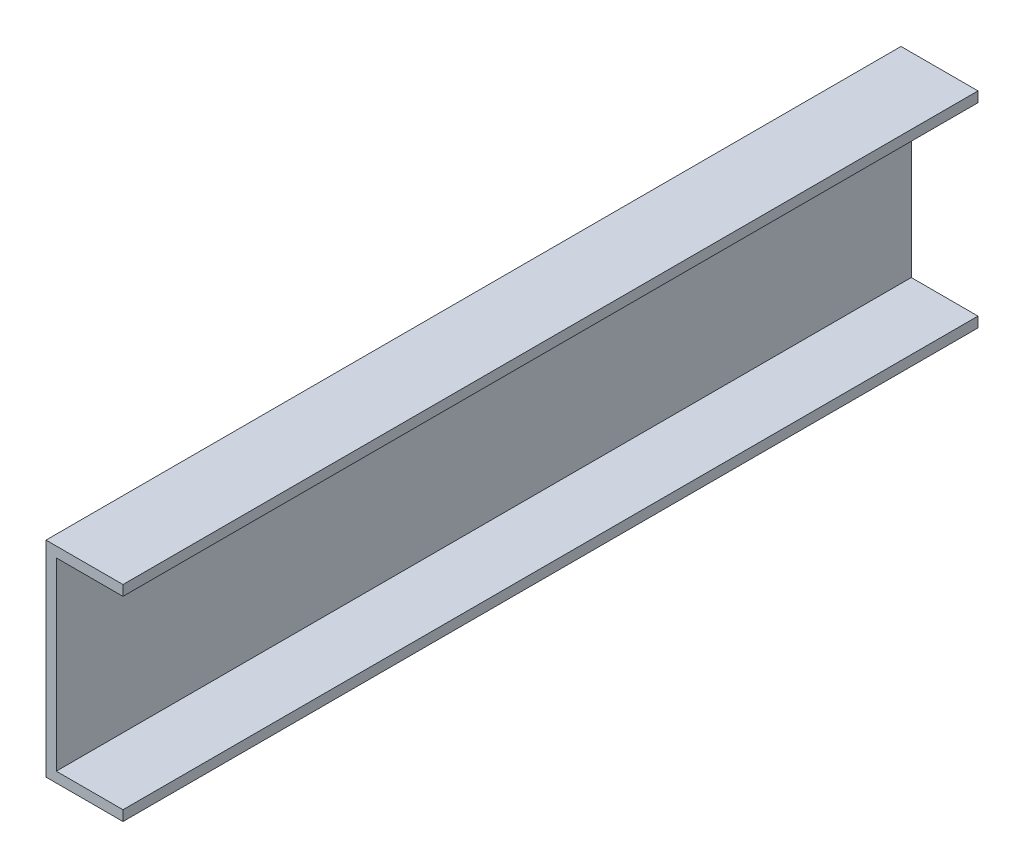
from build123d import *

# Parameters (mm, degrees)
BOSS_EXTRUDE1_DEPTH = 416.5


with BuildPart() as part:
    # Sketch1 → Boss-Extrude1 (new, symmetric)
    with BuildSketch(Plane.XY):
        Polygon((75, 0), (0, 0), (0, 200), (75, 200), (75, 190), (10, 190), (10, 10), (75, 10), align=None)
    extrude(amount=BOSS_EXTRUDE1_DEPTH, both=True)


solid = part.part
